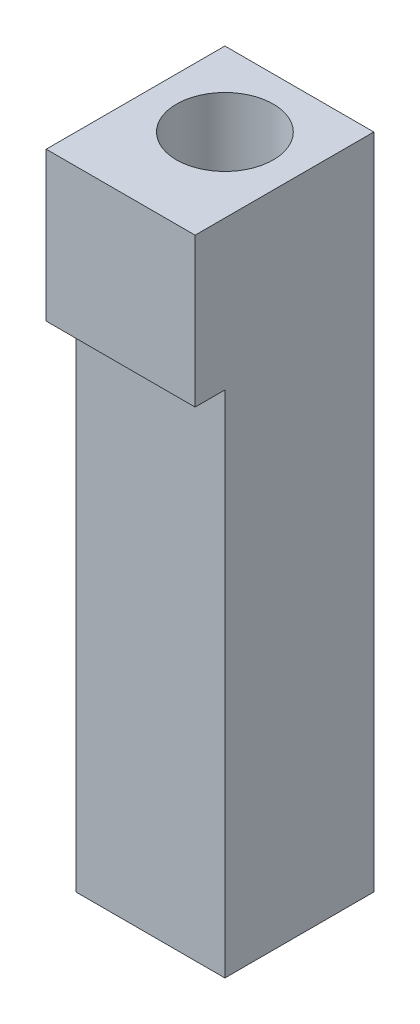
ISO-10303-21;
HEADER;
FILE_DESCRIPTION(('STEP AP214'),'2;1');
FILE_NAME('part.step','',(''),(''),'','','');
FILE_SCHEMA(('AUTOMOTIVE_DESIGN { 1 0 10303 214 1 1 1 1 }'));
ENDSEC;
DATA;
#1=APPLICATION_CONTEXT('core data for automotive mechanical design processes');
#2=APPLICATION_PROTOCOL_DEFINITION('international standard','automotive_design',2000,#1);
#3=PRODUCT_CONTEXT('',#1,'mechanical');
#4=PRODUCT('Part','Part','',(#3));
#5=PRODUCT_RELATED_PRODUCT_CATEGORY('part','',(#4));
#6=PRODUCT_DEFINITION_FORMATION('','',#4);
#7=PRODUCT_DEFINITION_CONTEXT('part definition',#1,'design');
#8=PRODUCT_DEFINITION('design','',#6,#7);
#9=PRODUCT_DEFINITION_SHAPE('','',#8);
#10=(LENGTH_UNIT() NAMED_UNIT(*) SI_UNIT(.MILLI.,.METRE.));
#11=(NAMED_UNIT(*) PLANE_ANGLE_UNIT() SI_UNIT($,.RADIAN.));
#12=(NAMED_UNIT(*) SI_UNIT($,.STERADIAN.) SOLID_ANGLE_UNIT());
#13=UNCERTAINTY_MEASURE_WITH_UNIT(LENGTH_MEASURE(1.E-05),#10,'distance_accuracy_value','');
#14=(GEOMETRIC_REPRESENTATION_CONTEXT(3) GLOBAL_UNCERTAINTY_ASSIGNED_CONTEXT((#13)) GLOBAL_UNIT_ASSIGNED_CONTEXT((#10,
#11,#12)) REPRESENTATION_CONTEXT('',''));
#15=CARTESIAN_POINT('',(0.,0.,0.));
#16=DIRECTION('',(0.,0.,1.));
#17=DIRECTION('',(1.,0.,0.));
#18=AXIS2_PLACEMENT_3D('',#15,#16,#17);
#19=CARTESIAN_POINT('',(0.,0.,12.));
#20=DIRECTION('',(0.,1.,0.));
#21=DIRECTION('',(0.,0.,1.));
#22=AXIS2_PLACEMENT_3D('',#19,#20,#21);
#23=PLANE('',#22);
#24=DIRECTION('',(1.,0.,0.));
#25=VECTOR('',#24,1.);
#26=CARTESIAN_POINT('',(0.,0.,10.));
#27=LINE('',#26,#25);
#28=CARTESIAN_POINT('',(0.,0.,10.));
#29=VERTEX_POINT('',#28);
#30=CARTESIAN_POINT('',(10.,0.,10.));
#31=VERTEX_POINT('',#30);
#32=EDGE_CURVE('E81',#29,#31,#27,.T.);
#33=ORIENTED_EDGE('',*,*,#32,.F.);
#34=DIRECTION('',(0.,0.,-1.));
#35=VECTOR('',#34,1.);
#36=CARTESIAN_POINT('',(0.,0.,12.));
#37=LINE('',#36,#35);
#38=CARTESIAN_POINT('',(0.,0.,0.));
#39=VERTEX_POINT('',#38);
#40=EDGE_CURVE('E75',#29,#39,#37,.T.);
#41=ORIENTED_EDGE('',*,*,#40,.T.);
#42=DIRECTION('',(1.,0.,0.));
#43=VECTOR('',#42,1.);
#44=CARTESIAN_POINT('',(0.,0.,0.));
#45=LINE('',#44,#43);
#46=CARTESIAN_POINT('',(10.,0.,0.));
#47=VERTEX_POINT('',#46);
#48=EDGE_CURVE('E79',#39,#47,#45,.T.);
#49=ORIENTED_EDGE('',*,*,#48,.T.);
#50=DIRECTION('',(0.,0.,-1.));
#51=VECTOR('',#50,1.);
#52=CARTESIAN_POINT('',(10.,0.,12.));
#53=LINE('',#52,#51);
#54=EDGE_CURVE('E12',#31,#47,#53,.T.);
#55=ORIENTED_EDGE('',*,*,#54,.F.);
#56=EDGE_LOOP('',(#33,#41,#49,#55));
#57=FACE_BOUND('',#56,.T.);
#58=ADVANCED_FACE('F33',(#57),#23,.F.);
#59=CARTESIAN_POINT('',(10.,0.,12.));
#60=DIRECTION('',(-1.,0.,0.));
#61=DIRECTION('',(0.,0.,1.));
#62=AXIS2_PLACEMENT_3D('',#59,#60,#61);
#63=PLANE('',#62);
#64=DIRECTION('',(0.,0.,-1.));
#65=VECTOR('',#64,1.);
#66=CARTESIAN_POINT('',(10.,34.2000000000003,12.));
#67=LINE('',#66,#65);
#68=CARTESIAN_POINT('',(10.,34.2000000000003,12.));
#69=VERTEX_POINT('',#68);
#70=CARTESIAN_POINT('',(10.,34.2000000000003,10.));
#71=VERTEX_POINT('',#70);
#72=EDGE_CURVE('E47',#69,#71,#67,.T.);
#73=ORIENTED_EDGE('',*,*,#72,.T.);
#74=DIRECTION('',(0.,-1.,0.));
#75=VECTOR('',#74,1.);
#76=CARTESIAN_POINT('',(10.,0.,10.));
#77=LINE('',#76,#75);
#78=EDGE_CURVE('E119',#71,#31,#77,.T.);
#79=ORIENTED_EDGE('',*,*,#78,.T.);
#80=ORIENTED_EDGE('',*,*,#54,.T.);
#81=DIRECTION('',(0.,1.,0.));
#82=VECTOR('',#81,1.);
#83=CARTESIAN_POINT('',(10.,0.,0.));
#84=LINE('',#83,#82);
#85=CARTESIAN_POINT('',(10.,44.2000000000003,0.));
#86=VERTEX_POINT('',#85);
#87=EDGE_CURVE('E100',#47,#86,#84,.T.);
#88=ORIENTED_EDGE('',*,*,#87,.T.);
#89=DIRECTION('',(0.,0.,-1.));
#90=VECTOR('',#89,1.);
#91=CARTESIAN_POINT('',(10.,44.2000000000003,12.));
#92=LINE('',#91,#90);
#93=CARTESIAN_POINT('',(10.,44.2000000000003,12.));
#94=VERTEX_POINT('',#93);
#95=EDGE_CURVE('E40',#94,#86,#92,.T.);
#96=ORIENTED_EDGE('',*,*,#95,.F.);
#97=DIRECTION('',(0.,1.,0.));
#98=VECTOR('',#97,1.);
#99=CARTESIAN_POINT('',(10.,0.,12.));
#100=LINE('',#99,#98);
#101=EDGE_CURVE('E95',#69,#94,#100,.T.);
#102=ORIENTED_EDGE('',*,*,#101,.F.);
#103=EDGE_LOOP('',(#73,#79,#80,#88,#96,#102));
#104=FACE_BOUND('',#103,.T.);
#105=ADVANCED_FACE('F115',(#104),#63,.F.);
#106=CARTESIAN_POINT('',(0.,0.,12.));
#107=DIRECTION('',(1.,0.,0.));
#108=DIRECTION('',(0.,0.,-1.));
#109=AXIS2_PLACEMENT_3D('',#106,#107,#108);
#110=PLANE('',#109);
#111=DIRECTION('',(0.,0.,-1.));
#112=VECTOR('',#111,1.);
#113=CARTESIAN_POINT('',(0.,34.2000000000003,12.));
#114=LINE('',#113,#112);
#115=CARTESIAN_POINT('',(0.,34.2000000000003,12.));
#116=VERTEX_POINT('',#115);
#117=CARTESIAN_POINT('',(0.,34.2000000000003,10.));
#118=VERTEX_POINT('',#117);
#119=EDGE_CURVE('E134',#116,#118,#114,.T.);
#120=ORIENTED_EDGE('',*,*,#119,.F.);
#121=DIRECTION('',(0.,-1.,0.));
#122=VECTOR('',#121,1.);
#123=CARTESIAN_POINT('',(0.,0.,12.));
#124=LINE('',#123,#122);
#125=CARTESIAN_POINT('',(0.,44.2000000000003,12.));
#126=VERTEX_POINT('',#125);
#127=EDGE_CURVE('E85',#126,#116,#124,.T.);
#128=ORIENTED_EDGE('',*,*,#127,.F.);
#129=DIRECTION('',(0.,0.,-1.));
#130=VECTOR('',#129,1.);
#131=CARTESIAN_POINT('',(0.,44.2000000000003,12.));
#132=LINE('',#131,#130);
#133=CARTESIAN_POINT('',(0.,44.2000000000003,0.));
#134=VERTEX_POINT('',#133);
#135=EDGE_CURVE('E84',#126,#134,#132,.T.);
#136=ORIENTED_EDGE('',*,*,#135,.T.);
#137=DIRECTION('',(0.,-1.,0.));
#138=VECTOR('',#137,1.);
#139=CARTESIAN_POINT('',(0.,0.,0.));
#140=LINE('',#139,#138);
#141=EDGE_CURVE('E89',#134,#39,#140,.T.);
#142=ORIENTED_EDGE('',*,*,#141,.T.);
#143=ORIENTED_EDGE('',*,*,#40,.F.);
#144=DIRECTION('',(0.,-1.,0.));
#145=VECTOR('',#144,1.);
#146=CARTESIAN_POINT('',(0.,0.,10.));
#147=LINE('',#146,#145);
#148=EDGE_CURVE('E130',#118,#29,#147,.T.);
#149=ORIENTED_EDGE('',*,*,#148,.F.);
#150=EDGE_LOOP('',(#120,#128,#136,#142,#143,#149));
#151=FACE_BOUND('',#150,.T.);
#152=ADVANCED_FACE('F91',(#151),#110,.F.);
#153=CARTESIAN_POINT('',(10.,0.,12.));
#154=DIRECTION('',(0.,0.,1.));
#155=DIRECTION('',(1.,0.,0.));
#156=AXIS2_PLACEMENT_3D('',#153,#154,#155);
#157=PLANE('',#156);
#158=ORIENTED_EDGE('',*,*,#127,.T.);
#159=DIRECTION('',(1.,0.,0.));
#160=VECTOR('',#159,1.);
#161=CARTESIAN_POINT('',(0.,34.2000000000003,12.));
#162=LINE('',#161,#160);
#163=EDGE_CURVE('E101',#116,#69,#162,.T.);
#164=ORIENTED_EDGE('',*,*,#163,.T.);
#165=ORIENTED_EDGE('',*,*,#101,.T.);
#166=DIRECTION('',(-1.,0.,0.));
#167=VECTOR('',#166,1.);
#168=CARTESIAN_POINT('',(0.,44.2000000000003,12.));
#169=LINE('',#168,#167);
#170=EDGE_CURVE('E56',#94,#126,#169,.T.);
#171=ORIENTED_EDGE('',*,*,#170,.T.);
#172=EDGE_LOOP('',(#158,#164,#165,#171));
#173=FACE_BOUND('',#172,.T.);
#174=ADVANCED_FACE('F144',(#173),#157,.T.);
#175=CARTESIAN_POINT('',(0.,44.2000000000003,12.));
#176=DIRECTION('',(0.,-1.,0.));
#177=DIRECTION('',(0.,0.,-1.));
#178=AXIS2_PLACEMENT_3D('',#175,#176,#177);
#179=PLANE('',#178);
#180=CARTESIAN_POINT('',(5.,44.2000000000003,5.));
#181=DIRECTION('',(0.,1.,0.));
#182=DIRECTION('',(0.,0.,1.));
#183=AXIS2_PLACEMENT_3D('',#180,#181,#182);
#184=CIRCLE('',#183,3.25);
#185=CARTESIAN_POINT('',(5.,44.2000000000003,8.25));
#186=VERTEX_POINT('',#185);
#187=EDGE_CURVE('E229',#186,#186,#184,.T.);
#188=ORIENTED_EDGE('',*,*,#187,.F.);
#189=EDGE_LOOP('',(#188));
#190=FACE_BOUND('',#189,.T.);
#191=DIRECTION('',(-1.,0.,0.));
#192=VECTOR('',#191,1.);
#193=CARTESIAN_POINT('',(0.,44.2000000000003,0.));
#194=LINE('',#193,#192);
#195=EDGE_CURVE('E96',#86,#134,#194,.T.);
#196=ORIENTED_EDGE('',*,*,#195,.T.);
#197=ORIENTED_EDGE('',*,*,#135,.F.);
#198=ORIENTED_EDGE('',*,*,#170,.F.);
#199=ORIENTED_EDGE('',*,*,#95,.T.);
#200=EDGE_LOOP('',(#196,#197,#198,#199));
#201=FACE_BOUND('',#200,.T.);
#202=ADVANCED_FACE('F112',(#190,#201),#179,.F.);
#203=CARTESIAN_POINT('',(10.,0.,0.));
#204=DIRECTION('',(0.,0.,1.));
#205=DIRECTION('',(1.,0.,0.));
#206=AXIS2_PLACEMENT_3D('',#203,#204,#205);
#207=PLANE('',#206);
#208=ORIENTED_EDGE('',*,*,#48,.F.);
#209=ORIENTED_EDGE('',*,*,#141,.F.);
#210=ORIENTED_EDGE('',*,*,#195,.F.);
#211=ORIENTED_EDGE('',*,*,#87,.F.);
#212=EDGE_LOOP('',(#208,#209,#210,#211));
#213=FACE_BOUND('',#212,.T.);
#214=ADVANCED_FACE('F99',(#213),#207,.F.);
#215=CARTESIAN_POINT('',(0.,34.2000000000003,12.));
#216=DIRECTION('',(0.,-1.,0.));
#217=DIRECTION('',(0.,0.,-1.));
#218=AXIS2_PLACEMENT_3D('',#215,#216,#217);
#219=PLANE('',#218);
#220=ORIENTED_EDGE('',*,*,#72,.F.);
#221=ORIENTED_EDGE('',*,*,#163,.F.);
#222=ORIENTED_EDGE('',*,*,#119,.T.);
#223=DIRECTION('',(1.,0.,0.));
#224=VECTOR('',#223,1.);
#225=CARTESIAN_POINT('',(0.,34.2000000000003,10.));
#226=LINE('',#225,#224);
#227=EDGE_CURVE('E132',#118,#71,#226,.T.);
#228=ORIENTED_EDGE('',*,*,#227,.T.);
#229=EDGE_LOOP('',(#220,#221,#222,#228));
#230=FACE_BOUND('',#229,.T.);
#231=ADVANCED_FACE('F145',(#230),#219,.T.);
#232=CARTESIAN_POINT('',(0.,0.,10.));
#233=DIRECTION('',(0.,0.,1.));
#234=DIRECTION('',(1.,0.,0.));
#235=AXIS2_PLACEMENT_3D('',#232,#233,#234);
#236=PLANE('',#235);
#237=ORIENTED_EDGE('',*,*,#78,.F.);
#238=ORIENTED_EDGE('',*,*,#227,.F.);
#239=ORIENTED_EDGE('',*,*,#148,.T.);
#240=ORIENTED_EDGE('',*,*,#32,.T.);
#241=EDGE_LOOP('',(#237,#238,#239,#240));
#242=FACE_BOUND('',#241,.T.);
#243=ADVANCED_FACE('F131',(#242),#236,.T.);
#244=CARTESIAN_POINT('',(5.,39.2000000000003,5.));
#245=DIRECTION('',(0.,1.,0.));
#246=DIRECTION('',(0.,0.,1.));
#247=AXIS2_PLACEMENT_3D('',#244,#245,#246);
#248=CYLINDRICAL_SURFACE('',#247,3.25);
#249=CARTESIAN_POINT('',(5.,39.2000000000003,5.));
#250=DIRECTION('',(0.,1.,0.));
#251=DIRECTION('',(0.,0.,1.));
#252=AXIS2_PLACEMENT_3D('',#249,#250,#251);
#253=CIRCLE('',#252,3.25);
#254=CARTESIAN_POINT('',(5.,39.2000000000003,8.25));
#255=VERTEX_POINT('',#254);
#256=EDGE_CURVE('E141',#255,#255,#253,.T.);
#257=ORIENTED_EDGE('',*,*,#256,.F.);
#258=EDGE_LOOP('',(#257));
#259=FACE_BOUND('',#258,.T.);
#260=ORIENTED_EDGE('',*,*,#187,.T.);
#261=EDGE_LOOP('',(#260));
#262=FACE_BOUND('',#261,.T.);
#263=ADVANCED_FACE('F152',(#259,#262),#248,.F.);
#264=CARTESIAN_POINT('',(5.,39.2000000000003,5.));
#265=DIRECTION('',(0.,1.,0.));
#266=DIRECTION('',(0.,0.,1.));
#267=AXIS2_PLACEMENT_3D('',#264,#265,#266);
#268=PLANE('',#267);
#269=ORIENTED_EDGE('',*,*,#256,.T.);
#270=EDGE_LOOP('',(#269));
#271=FACE_BOUND('',#270,.T.);
#272=ADVANCED_FACE('F213',(#271),#268,.T.);
#273=CLOSED_SHELL('',(#58,#105,#152,#174,#202,#214,#231,#243,#263,#272));
#274=MANIFOLD_SOLID_BREP('B2',#273);
#275=ADVANCED_BREP_SHAPE_REPRESENTATION('',(#18,#274),#14);
#276=SHAPE_DEFINITION_REPRESENTATION(#9,#275);
ENDSEC;
END-ISO-10303-21;
